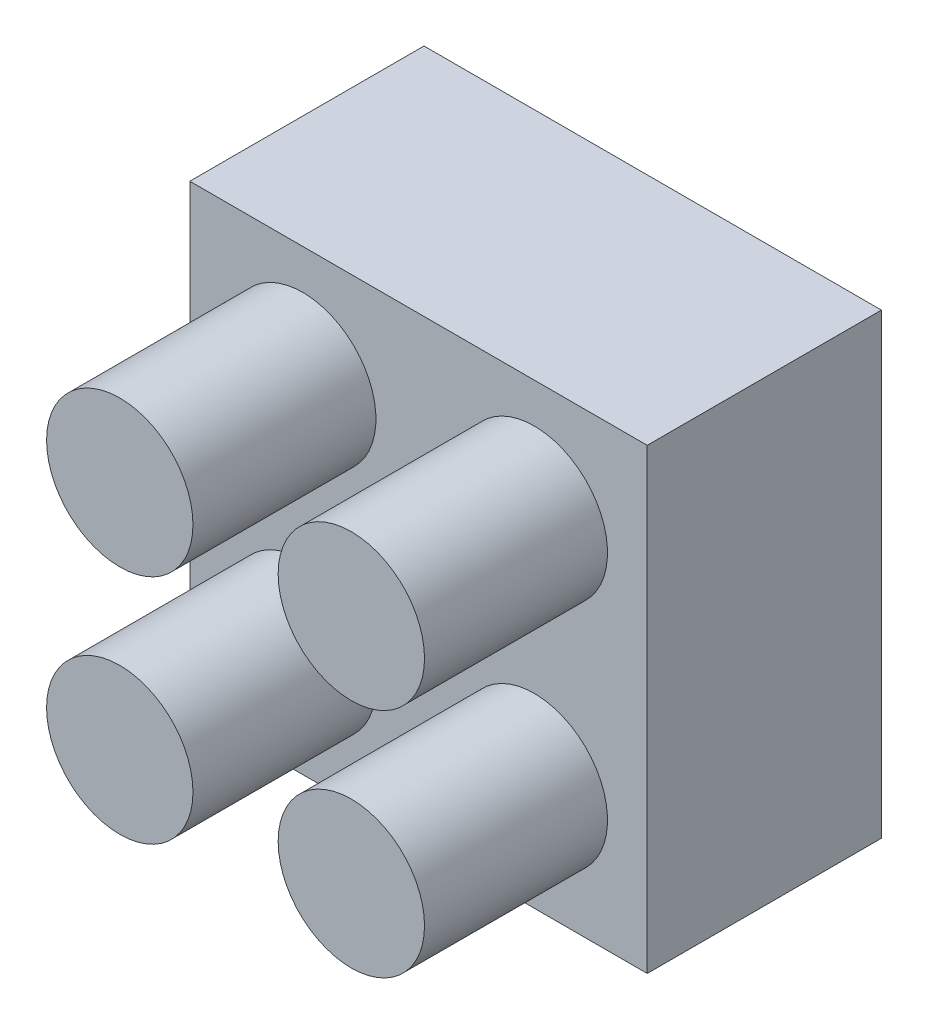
ISO-10303-21;
HEADER;
FILE_DESCRIPTION(('STEP AP214'),'2;1');
FILE_NAME('part.step','',(''),(''),'','','');
FILE_SCHEMA(('AUTOMOTIVE_DESIGN { 1 0 10303 214 1 1 1 1 }'));
ENDSEC;
DATA;
#1=APPLICATION_CONTEXT('core data for automotive mechanical design processes');
#2=APPLICATION_PROTOCOL_DEFINITION('international standard','automotive_design',2000,#1);
#3=PRODUCT_CONTEXT('',#1,'mechanical');
#4=PRODUCT('Part','Part','',(#3));
#5=PRODUCT_RELATED_PRODUCT_CATEGORY('part','',(#4));
#6=PRODUCT_DEFINITION_FORMATION('','',#4);
#7=PRODUCT_DEFINITION_CONTEXT('part definition',#1,'design');
#8=PRODUCT_DEFINITION('design','',#6,#7);
#9=PRODUCT_DEFINITION_SHAPE('','',#8);
#10=(LENGTH_UNIT() NAMED_UNIT(*) SI_UNIT(.MILLI.,.METRE.));
#11=(NAMED_UNIT(*) PLANE_ANGLE_UNIT() SI_UNIT($,.RADIAN.));
#12=(NAMED_UNIT(*) SI_UNIT($,.STERADIAN.) SOLID_ANGLE_UNIT());
#13=UNCERTAINTY_MEASURE_WITH_UNIT(LENGTH_MEASURE(1.E-05),#10,'distance_accuracy_value','');
#14=(GEOMETRIC_REPRESENTATION_CONTEXT(3) GLOBAL_UNCERTAINTY_ASSIGNED_CONTEXT((#13)) GLOBAL_UNIT_ASSIGNED_CONTEXT((#10,
#11,#12)) REPRESENTATION_CONTEXT('',''));
#15=CARTESIAN_POINT('',(0.,0.,0.));
#16=DIRECTION('',(0.,0.,1.));
#17=DIRECTION('',(1.,0.,0.));
#18=AXIS2_PLACEMENT_3D('',#15,#16,#17);
#19=CARTESIAN_POINT('',(7.9375,-7.9375,8.128));
#20=DIRECTION('',(-1.,0.,0.));
#21=DIRECTION('',(0.,0.,1.));
#22=AXIS2_PLACEMENT_3D('',#19,#20,#21);
#23=PLANE('',#22);
#24=DIRECTION('',(0.,1.,0.));
#25=VECTOR('',#24,1.);
#26=CARTESIAN_POINT('',(7.9375,-7.9375,0.));
#27=LINE('',#26,#25);
#28=CARTESIAN_POINT('',(7.9375,-7.9375,0.));
#29=VERTEX_POINT('',#28);
#30=CARTESIAN_POINT('',(7.9375,7.9375,0.));
#31=VERTEX_POINT('',#30);
#32=EDGE_CURVE('E103',#29,#31,#27,.T.);
#33=ORIENTED_EDGE('',*,*,#32,.T.);
#34=DIRECTION('',(0.,0.,-1.));
#35=VECTOR('',#34,1.);
#36=CARTESIAN_POINT('',(7.9375,7.9375,8.128));
#37=LINE('',#36,#35);
#38=CARTESIAN_POINT('',(7.9375,7.9375,8.128));
#39=VERTEX_POINT('',#38);
#40=EDGE_CURVE('E94',#39,#31,#37,.T.);
#41=ORIENTED_EDGE('',*,*,#40,.F.);
#42=DIRECTION('',(0.,1.,0.));
#43=VECTOR('',#42,1.);
#44=CARTESIAN_POINT('',(7.9375,-7.9375,8.128));
#45=LINE('',#44,#43);
#46=CARTESIAN_POINT('',(7.9375,-7.9375,8.128));
#47=VERTEX_POINT('',#46);
#48=EDGE_CURVE('E88',#47,#39,#45,.T.);
#49=ORIENTED_EDGE('',*,*,#48,.F.);
#50=DIRECTION('',(0.,0.,-1.));
#51=VECTOR('',#50,1.);
#52=CARTESIAN_POINT('',(7.9375,-7.9375,8.128));
#53=LINE('',#52,#51);
#54=EDGE_CURVE('E99',#47,#29,#53,.T.);
#55=ORIENTED_EDGE('',*,*,#54,.T.);
#56=EDGE_LOOP('',(#33,#41,#49,#55));
#57=FACE_BOUND('',#56,.T.);
#58=ADVANCED_FACE('F36',(#57),#23,.F.);
#59=CARTESIAN_POINT('',(-7.9375,7.9375,8.128));
#60=DIRECTION('',(0.,-1.,0.));
#61=DIRECTION('',(0.,0.,-1.));
#62=AXIS2_PLACEMENT_3D('',#59,#60,#61);
#63=PLANE('',#62);
#64=DIRECTION('',(-1.,0.,0.));
#65=VECTOR('',#64,1.);
#66=CARTESIAN_POINT('',(-7.9375,7.9375,0.));
#67=LINE('',#66,#65);
#68=CARTESIAN_POINT('',(-7.9375,7.9375,0.));
#69=VERTEX_POINT('',#68);
#70=EDGE_CURVE('E93',#31,#69,#67,.T.);
#71=ORIENTED_EDGE('',*,*,#70,.T.);
#72=DIRECTION('',(0.,0.,-1.));
#73=VECTOR('',#72,1.);
#74=CARTESIAN_POINT('',(-7.9375,7.9375,8.128));
#75=LINE('',#74,#73);
#76=CARTESIAN_POINT('',(-7.9375,7.9375,8.128));
#77=VERTEX_POINT('',#76);
#78=EDGE_CURVE('E91',#77,#69,#75,.T.);
#79=ORIENTED_EDGE('',*,*,#78,.F.);
#80=DIRECTION('',(-1.,0.,0.));
#81=VECTOR('',#80,1.);
#82=CARTESIAN_POINT('',(-7.9375,7.9375,8.128));
#83=LINE('',#82,#81);
#84=EDGE_CURVE('E83',#39,#77,#83,.T.);
#85=ORIENTED_EDGE('',*,*,#84,.F.);
#86=ORIENTED_EDGE('',*,*,#40,.T.);
#87=EDGE_LOOP('',(#71,#79,#85,#86));
#88=FACE_BOUND('',#87,.T.);
#89=ADVANCED_FACE('F92',(#88),#63,.F.);
#90=CARTESIAN_POINT('',(-7.9375,-7.9375,8.128));
#91=DIRECTION('',(1.,0.,0.));
#92=DIRECTION('',(0.,0.,-1.));
#93=AXIS2_PLACEMENT_3D('',#90,#91,#92);
#94=PLANE('',#93);
#95=DIRECTION('',(0.,-1.,0.));
#96=VECTOR('',#95,1.);
#97=CARTESIAN_POINT('',(-7.9375,-7.9375,0.));
#98=LINE('',#97,#96);
#99=CARTESIAN_POINT('',(-7.9375,-7.9375,0.));
#100=VERTEX_POINT('',#99);
#101=EDGE_CURVE('E69',#69,#100,#98,.T.);
#102=ORIENTED_EDGE('',*,*,#101,.T.);
#103=DIRECTION('',(0.,0.,-1.));
#104=VECTOR('',#103,1.);
#105=CARTESIAN_POINT('',(-7.9375,-7.9375,8.128));
#106=LINE('',#105,#104);
#107=CARTESIAN_POINT('',(-7.9375,-7.9375,8.128));
#108=VERTEX_POINT('',#107);
#109=EDGE_CURVE('E95',#108,#100,#106,.T.);
#110=ORIENTED_EDGE('',*,*,#109,.F.);
#111=DIRECTION('',(0.,-1.,0.));
#112=VECTOR('',#111,1.);
#113=CARTESIAN_POINT('',(-7.9375,-7.9375,8.128));
#114=LINE('',#113,#112);
#115=EDGE_CURVE('E86',#77,#108,#114,.T.);
#116=ORIENTED_EDGE('',*,*,#115,.F.);
#117=ORIENTED_EDGE('',*,*,#78,.T.);
#118=EDGE_LOOP('',(#102,#110,#116,#117));
#119=FACE_BOUND('',#118,.T.);
#120=ADVANCED_FACE('F97',(#119),#94,.F.);
#121=CARTESIAN_POINT('',(-7.9375,-7.9375,8.128));
#122=DIRECTION('',(0.,1.,0.));
#123=DIRECTION('',(0.,0.,1.));
#124=AXIS2_PLACEMENT_3D('',#121,#122,#123);
#125=PLANE('',#124);
#126=DIRECTION('',(1.,0.,0.));
#127=VECTOR('',#126,1.);
#128=CARTESIAN_POINT('',(-7.9375,-7.9375,0.));
#129=LINE('',#128,#127);
#130=EDGE_CURVE('E75',#100,#29,#129,.T.);
#131=ORIENTED_EDGE('',*,*,#130,.T.);
#132=ORIENTED_EDGE('',*,*,#54,.F.);
#133=DIRECTION('',(1.,0.,0.));
#134=VECTOR('',#133,1.);
#135=CARTESIAN_POINT('',(-7.9375,-7.9375,8.128));
#136=LINE('',#135,#134);
#137=EDGE_CURVE('E52',#108,#47,#136,.T.);
#138=ORIENTED_EDGE('',*,*,#137,.F.);
#139=ORIENTED_EDGE('',*,*,#109,.T.);
#140=EDGE_LOOP('',(#131,#132,#138,#139));
#141=FACE_BOUND('',#140,.T.);
#142=ADVANCED_FACE('F126',(#141),#125,.F.);
#143=CARTESIAN_POINT('',(0.,0.,8.128));
#144=DIRECTION('',(0.,0.,-1.));
#145=DIRECTION('',(-1.,0.,0.));
#146=AXIS2_PLACEMENT_3D('',#143,#144,#145);
#147=PLANE('',#146);
#148=CARTESIAN_POINT('',(-4.01832897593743,-4.01832897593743,8.128));
#149=DIRECTION('',(0.,0.,-1.));
#150=DIRECTION('',(-1.,0.,0.));
#151=AXIS2_PLACEMENT_3D('',#148,#149,#150);
#152=CIRCLE('',#151,2.54);
#153=CARTESIAN_POINT('',(-6.55832897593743,-4.01832897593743,8.128));
#154=VERTEX_POINT('',#153);
#155=EDGE_CURVE('E11',#154,#154,#152,.F.);
#156=ORIENTED_EDGE('',*,*,#155,.F.);
#157=EDGE_LOOP('',(#156));
#158=FACE_BOUND('',#157,.T.);
#159=CARTESIAN_POINT('',(4.01832897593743,-4.01832897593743,8.128));
#160=DIRECTION('',(0.,0.,-1.));
#161=DIRECTION('',(-1.,0.,0.));
#162=AXIS2_PLACEMENT_3D('',#159,#160,#161);
#163=CIRCLE('',#162,2.54);
#164=CARTESIAN_POINT('',(1.47832897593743,-4.01832897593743,8.128));
#165=VERTEX_POINT('',#164);
#166=EDGE_CURVE('E44',#165,#165,#163,.F.);
#167=ORIENTED_EDGE('',*,*,#166,.F.);
#168=EDGE_LOOP('',(#167));
#169=FACE_BOUND('',#168,.T.);
#170=CARTESIAN_POINT('',(4.01832897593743,4.01832897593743,8.128));
#171=DIRECTION('',(0.,0.,-1.));
#172=DIRECTION('',(-1.,0.,0.));
#173=AXIS2_PLACEMENT_3D('',#170,#171,#172);
#174=CIRCLE('',#173,2.54);
#175=CARTESIAN_POINT('',(1.47832897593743,4.01832897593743,8.128));
#176=VERTEX_POINT('',#175);
#177=EDGE_CURVE('E116',#176,#176,#174,.F.);
#178=ORIENTED_EDGE('',*,*,#177,.F.);
#179=EDGE_LOOP('',(#178));
#180=FACE_BOUND('',#179,.T.);
#181=CARTESIAN_POINT('',(-4.01832897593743,4.01832897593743,8.128));
#182=DIRECTION('',(0.,0.,-1.));
#183=DIRECTION('',(-1.,0.,0.));
#184=AXIS2_PLACEMENT_3D('',#181,#182,#183);
#185=CIRCLE('',#184,2.54);
#186=CARTESIAN_POINT('',(-6.55832897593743,4.01832897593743,8.128));
#187=VERTEX_POINT('',#186);
#188=EDGE_CURVE('E113',#187,#187,#185,.F.);
#189=ORIENTED_EDGE('',*,*,#188,.F.);
#190=EDGE_LOOP('',(#189));
#191=FACE_BOUND('',#190,.T.);
#192=ORIENTED_EDGE('',*,*,#48,.T.);
#193=ORIENTED_EDGE('',*,*,#84,.T.);
#194=ORIENTED_EDGE('',*,*,#115,.T.);
#195=ORIENTED_EDGE('',*,*,#137,.T.);
#196=EDGE_LOOP('',(#192,#193,#194,#195));
#197=FACE_BOUND('',#196,.T.);
#198=ADVANCED_FACE('F84',(#158,#169,#180,#191,#197),#147,.F.);
#199=CARTESIAN_POINT('',(0.,0.,0.));
#200=DIRECTION('',(0.,0.,-1.));
#201=DIRECTION('',(-1.,0.,0.));
#202=AXIS2_PLACEMENT_3D('',#199,#200,#201);
#203=PLANE('',#202);
#204=ORIENTED_EDGE('',*,*,#32,.F.);
#205=ORIENTED_EDGE('',*,*,#130,.F.);
#206=ORIENTED_EDGE('',*,*,#101,.F.);
#207=ORIENTED_EDGE('',*,*,#70,.F.);
#208=EDGE_LOOP('',(#204,#205,#206,#207));
#209=FACE_BOUND('',#208,.T.);
#210=ADVANCED_FACE('F125',(#209),#203,.T.);
#211=CARTESIAN_POINT('',(-4.01832897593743,4.01832897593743,14.478));
#212=DIRECTION('',(0.,0.,-1.));
#213=DIRECTION('',(-1.,0.,0.));
#214=AXIS2_PLACEMENT_3D('',#211,#212,#213);
#215=CYLINDRICAL_SURFACE('',#214,2.54);
#216=CARTESIAN_POINT('',(-4.01832897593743,4.01832897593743,14.478));
#217=DIRECTION('',(0.,0.,1.));
#218=DIRECTION('',(1.,0.,0.));
#219=AXIS2_PLACEMENT_3D('',#216,#217,#218);
#220=CIRCLE('',#219,2.54);
#221=CARTESIAN_POINT('',(-1.47832897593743,4.01832897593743,14.478));
#222=VERTEX_POINT('',#221);
#223=EDGE_CURVE('E106',#222,#222,#220,.T.);
#224=ORIENTED_EDGE('',*,*,#223,.F.);
#225=EDGE_LOOP('',(#224));
#226=FACE_BOUND('',#225,.T.);
#227=ORIENTED_EDGE('',*,*,#188,.T.);
#228=EDGE_LOOP('',(#227));
#229=FACE_BOUND('',#228,.T.);
#230=ADVANCED_FACE('F133',(#226,#229),#215,.T.);
#231=CARTESIAN_POINT('',(0.,0.,14.478));
#232=DIRECTION('',(0.,0.,1.));
#233=DIRECTION('',(1.,0.,0.));
#234=AXIS2_PLACEMENT_3D('',#231,#232,#233);
#235=PLANE('',#234);
#236=ORIENTED_EDGE('',*,*,#223,.T.);
#237=EDGE_LOOP('',(#236));
#238=FACE_BOUND('',#237,.T.);
#239=ADVANCED_FACE('F135',(#238),#235,.T.);
#240=CARTESIAN_POINT('',(4.01832897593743,4.01832897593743,14.478));
#241=DIRECTION('',(0.,0.,-1.));
#242=DIRECTION('',(-1.,0.,0.));
#243=AXIS2_PLACEMENT_3D('',#240,#241,#242);
#244=CYLINDRICAL_SURFACE('',#243,2.54);
#245=CARTESIAN_POINT('',(4.01832897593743,4.01832897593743,14.478));
#246=DIRECTION('',(0.,0.,1.));
#247=DIRECTION('',(1.,0.,0.));
#248=AXIS2_PLACEMENT_3D('',#245,#246,#247);
#249=CIRCLE('',#248,2.54);
#250=CARTESIAN_POINT('',(6.55832897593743,4.01832897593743,14.478));
#251=VERTEX_POINT('',#250);
#252=EDGE_CURVE('E276',#251,#251,#249,.T.);
#253=ORIENTED_EDGE('',*,*,#252,.F.);
#254=EDGE_LOOP('',(#253));
#255=FACE_BOUND('',#254,.T.);
#256=ORIENTED_EDGE('',*,*,#177,.T.);
#257=EDGE_LOOP('',(#256));
#258=FACE_BOUND('',#257,.T.);
#259=ADVANCED_FACE('F142',(#255,#258),#244,.T.);
#260=CARTESIAN_POINT('',(0.,0.,14.478));
#261=DIRECTION('',(0.,0.,1.));
#262=DIRECTION('',(1.,0.,0.));
#263=AXIS2_PLACEMENT_3D('',#260,#261,#262);
#264=PLANE('',#263);
#265=ORIENTED_EDGE('',*,*,#252,.T.);
#266=EDGE_LOOP('',(#265));
#267=FACE_BOUND('',#266,.T.);
#268=ADVANCED_FACE('F208',(#267),#264,.T.);
#269=CARTESIAN_POINT('',(4.01832897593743,-4.01832897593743,14.478));
#270=DIRECTION('',(0.,0.,-1.));
#271=DIRECTION('',(-1.,0.,0.));
#272=AXIS2_PLACEMENT_3D('',#269,#270,#271);
#273=CYLINDRICAL_SURFACE('',#272,2.54);
#274=CARTESIAN_POINT('',(4.01832897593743,-4.01832897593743,14.478));
#275=DIRECTION('',(0.,0.,1.));
#276=DIRECTION('',(1.,0.,0.));
#277=AXIS2_PLACEMENT_3D('',#274,#275,#276);
#278=CIRCLE('',#277,2.54);
#279=CARTESIAN_POINT('',(6.55832897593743,-4.01832897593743,14.478));
#280=VERTEX_POINT('',#279);
#281=EDGE_CURVE('E273',#280,#280,#278,.T.);
#282=ORIENTED_EDGE('',*,*,#281,.F.);
#283=EDGE_LOOP('',(#282));
#284=FACE_BOUND('',#283,.T.);
#285=ORIENTED_EDGE('',*,*,#166,.T.);
#286=EDGE_LOOP('',(#285));
#287=FACE_BOUND('',#286,.T.);
#288=ADVANCED_FACE('F121',(#284,#287),#273,.T.);
#289=CARTESIAN_POINT('',(0.,0.,14.478));
#290=DIRECTION('',(0.,0.,1.));
#291=DIRECTION('',(1.,0.,0.));
#292=AXIS2_PLACEMENT_3D('',#289,#290,#291);
#293=PLANE('',#292);
#294=ORIENTED_EDGE('',*,*,#281,.T.);
#295=EDGE_LOOP('',(#294));
#296=FACE_BOUND('',#295,.T.);
#297=ADVANCED_FACE('F228',(#296),#293,.T.);
#298=CARTESIAN_POINT('',(-4.01832897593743,-4.01832897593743,14.478));
#299=DIRECTION('',(0.,0.,-1.));
#300=DIRECTION('',(-1.,0.,0.));
#301=AXIS2_PLACEMENT_3D('',#298,#299,#300);
#302=CYLINDRICAL_SURFACE('',#301,2.54);
#303=CARTESIAN_POINT('',(-4.01832897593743,-4.01832897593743,14.478));
#304=DIRECTION('',(0.,0.,1.));
#305=DIRECTION('',(1.,0.,0.));
#306=AXIS2_PLACEMENT_3D('',#303,#304,#305);
#307=CIRCLE('',#306,2.54);
#308=CARTESIAN_POINT('',(-1.47832897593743,-4.01832897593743,14.478));
#309=VERTEX_POINT('',#308);
#310=EDGE_CURVE('E272',#309,#309,#307,.T.);
#311=ORIENTED_EDGE('',*,*,#310,.F.);
#312=EDGE_LOOP('',(#311));
#313=FACE_BOUND('',#312,.T.);
#314=ORIENTED_EDGE('',*,*,#155,.T.);
#315=EDGE_LOOP('',(#314));
#316=FACE_BOUND('',#315,.T.);
#317=ADVANCED_FACE('F237',(#313,#316),#302,.T.);
#318=CARTESIAN_POINT('',(0.,0.,14.478));
#319=DIRECTION('',(0.,0.,1.));
#320=DIRECTION('',(1.,0.,0.));
#321=AXIS2_PLACEMENT_3D('',#318,#319,#320);
#322=PLANE('',#321);
#323=ORIENTED_EDGE('',*,*,#310,.T.);
#324=EDGE_LOOP('',(#323));
#325=FACE_BOUND('',#324,.T.);
#326=ADVANCED_FACE('F249',(#325),#322,.T.);
#327=CLOSED_SHELL('',(#58,#89,#120,#142,#198,#210,#230,#239,#259,#268,#288,#297,#317,#326));
#328=MANIFOLD_SOLID_BREP('B2',#327);
#329=ADVANCED_BREP_SHAPE_REPRESENTATION('',(#18,#328),#14);
#330=SHAPE_DEFINITION_REPRESENTATION(#9,#329);
ENDSEC;
END-ISO-10303-21;
